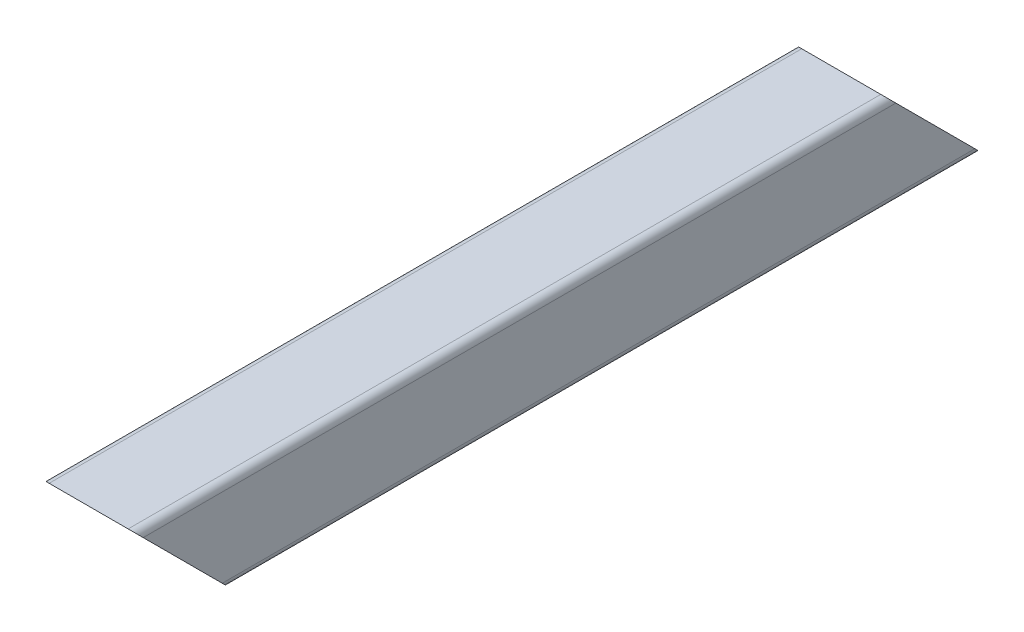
ISO-10303-21;
HEADER;
FILE_DESCRIPTION(('STEP AP214'),'2;1');
FILE_NAME('part.step','',(''),(''),'','','');
FILE_SCHEMA(('AUTOMOTIVE_DESIGN { 1 0 10303 214 1 1 1 1 }'));
ENDSEC;
DATA;
#1=APPLICATION_CONTEXT('core data for automotive mechanical design processes');
#2=APPLICATION_PROTOCOL_DEFINITION('international standard','automotive_design',2000,#1);
#3=PRODUCT_CONTEXT('',#1,'mechanical');
#4=PRODUCT('Part','Part','',(#3));
#5=PRODUCT_RELATED_PRODUCT_CATEGORY('part','',(#4));
#6=PRODUCT_DEFINITION_FORMATION('','',#4);
#7=PRODUCT_DEFINITION_CONTEXT('part definition',#1,'design');
#8=PRODUCT_DEFINITION('design','',#6,#7);
#9=PRODUCT_DEFINITION_SHAPE('','',#8);
#10=(LENGTH_UNIT() NAMED_UNIT(*) SI_UNIT(.MILLI.,.METRE.));
#11=(NAMED_UNIT(*) PLANE_ANGLE_UNIT() SI_UNIT($,.RADIAN.));
#12=(NAMED_UNIT(*) SI_UNIT($,.STERADIAN.) SOLID_ANGLE_UNIT());
#13=UNCERTAINTY_MEASURE_WITH_UNIT(LENGTH_MEASURE(1.E-05),#10,'distance_accuracy_value','');
#14=(GEOMETRIC_REPRESENTATION_CONTEXT(3) GLOBAL_UNCERTAINTY_ASSIGNED_CONTEXT((#13)) GLOBAL_UNIT_ASSIGNED_CONTEXT((#10,
#11,#12)) REPRESENTATION_CONTEXT('',''));
#15=CARTESIAN_POINT('',(0.,0.,0.));
#16=DIRECTION('',(0.,0.,1.));
#17=DIRECTION('',(1.,0.,0.));
#18=AXIS2_PLACEMENT_3D('',#15,#16,#17);
#19=CARTESIAN_POINT('',(4.,-4.,450.));
#20=DIRECTION('',(0.,0.,-1.));
#21=DIRECTION('',(-1.,0.,0.));
#22=AXIS2_PLACEMENT_3D('',#19,#20,#21);
#23=CYLINDRICAL_SURFACE('',#22,4.);
#24=DIRECTION('',(0.,0.,-1.));
#25=VECTOR('',#24,1.);
#26=CARTESIAN_POINT('',(4.00000000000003,0.,450.));
#27=LINE('',#26,#25);
#28=CARTESIAN_POINT('',(4.00000000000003,0.,450.));
#29=VERTEX_POINT('',#28);
#30=CARTESIAN_POINT('',(4.00000000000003,0.,50.0000000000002));
#31=VERTEX_POINT('',#30);
#32=EDGE_CURVE('E217',#29,#31,#27,.T.);
#33=ORIENTED_EDGE('',*,*,#32,.T.);
#34=CARTESIAN_POINT('',(4.,-4.,46.0000000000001));
#35=DIRECTION('',(0.,-0.707106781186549,0.707106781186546));
#36=DIRECTION('',(0.,-0.707106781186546,-0.707106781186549));
#37=AXIS2_PLACEMENT_3D('',#34,#35,#36);
#38=ELLIPSE('',#37,5.65685424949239,4.);
#39=CARTESIAN_POINT('',(0.,-4.00000000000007,46.0000000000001));
#40=VERTEX_POINT('',#39);
#41=EDGE_CURVE('E42',#31,#40,#38,.T.);
#42=ORIENTED_EDGE('',*,*,#41,.T.);
#43=DIRECTION('',(0.,0.,-1.));
#44=VECTOR('',#43,1.);
#45=CARTESIAN_POINT('',(0.,-4.00000000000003,450.));
#46=LINE('',#45,#44);
#47=CARTESIAN_POINT('',(0.,-4.00000000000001,446.));
#48=VERTEX_POINT('',#47);
#49=EDGE_CURVE('E156',#48,#40,#46,.T.);
#50=ORIENTED_EDGE('',*,*,#49,.F.);
#51=CARTESIAN_POINT('',(4.,-4.,446.));
#52=DIRECTION('',(0.,0.707106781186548,-0.707106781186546));
#53=DIRECTION('',(0.,-0.707106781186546,-0.707106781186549));
#54=AXIS2_PLACEMENT_3D('',#51,#52,#53);
#55=ELLIPSE('',#54,5.65685424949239,4.);
#56=EDGE_CURVE('E196',#48,#29,#55,.T.);
#57=ORIENTED_EDGE('',*,*,#56,.T.);
#58=EDGE_LOOP('',(#33,#42,#50,#57));
#59=FACE_BOUND('',#58,.T.);
#60=ADVANCED_FACE('F28',(#59),#23,.T.);
#61=CARTESIAN_POINT('',(0.,-4.00000000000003,450.));
#62=DIRECTION('',(1.,0.,0.));
#63=DIRECTION('',(0.,1.,0.));
#64=AXIS2_PLACEMENT_3D('',#61,#62,#63);
#65=PLANE('',#64);
#66=ORIENTED_EDGE('',*,*,#49,.T.);
#67=DIRECTION('',(0.,0.707106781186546,0.707106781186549));
#68=VECTOR('',#67,1.);
#69=CARTESIAN_POINT('',(0.,-50.,0.));
#70=LINE('',#69,#68);
#71=CARTESIAN_POINT('',(0.,-46.,4.00000000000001));
#72=VERTEX_POINT('',#71);
#73=EDGE_CURVE('E140',#72,#40,#70,.T.);
#74=ORIENTED_EDGE('',*,*,#73,.F.);
#75=DIRECTION('',(0.,0.,-1.));
#76=VECTOR('',#75,1.);
#77=CARTESIAN_POINT('',(0.,-46.,450.));
#78=LINE('',#77,#76);
#79=CARTESIAN_POINT('',(0.,-46.,404.));
#80=VERTEX_POINT('',#79);
#81=EDGE_CURVE('E154',#80,#72,#78,.T.);
#82=ORIENTED_EDGE('',*,*,#81,.F.);
#83=DIRECTION('',(0.,-0.707106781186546,-0.707106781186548));
#84=VECTOR('',#83,1.);
#85=CARTESIAN_POINT('',(0.,0.,450.));
#86=LINE('',#85,#84);
#87=EDGE_CURVE('E242',#48,#80,#86,.T.);
#88=ORIENTED_EDGE('',*,*,#87,.F.);
#89=EDGE_LOOP('',(#66,#74,#82,#88));
#90=FACE_BOUND('',#89,.T.);
#91=ADVANCED_FACE('F152',(#90),#65,.F.);
#92=CARTESIAN_POINT('',(4.00000000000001,-46.,450.));
#93=DIRECTION('',(0.,0.,-1.));
#94=DIRECTION('',(-1.,0.,0.));
#95=AXIS2_PLACEMENT_3D('',#92,#93,#94);
#96=CYLINDRICAL_SURFACE('',#95,4.);
#97=ORIENTED_EDGE('',*,*,#81,.T.);
#98=CARTESIAN_POINT('',(4.00000000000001,-46.,4.));
#99=DIRECTION('',(0.,-0.707106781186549,0.707106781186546));
#100=DIRECTION('',(0.,-0.707106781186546,-0.707106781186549));
#101=AXIS2_PLACEMENT_3D('',#98,#99,#100);
#102=ELLIPSE('',#101,5.65685424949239,4.);
#103=CARTESIAN_POINT('',(4.00000000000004,-50.,0.));
#104=VERTEX_POINT('',#103);
#105=EDGE_CURVE('E137',#72,#104,#102,.T.);
#106=ORIENTED_EDGE('',*,*,#105,.T.);
#107=DIRECTION('',(0.,0.,-1.));
#108=VECTOR('',#107,1.);
#109=CARTESIAN_POINT('',(4.00000000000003,-50.,450.));
#110=LINE('',#109,#108);
#111=CARTESIAN_POINT('',(4.00000000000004,-50.,400.));
#112=VERTEX_POINT('',#111);
#113=EDGE_CURVE('E162',#112,#104,#110,.T.);
#114=ORIENTED_EDGE('',*,*,#113,.F.);
#115=CARTESIAN_POINT('',(4.00000000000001,-46.,404.));
#116=DIRECTION('',(0.,0.707106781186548,-0.707106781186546));
#117=DIRECTION('',(0.,-0.707106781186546,-0.707106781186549));
#118=AXIS2_PLACEMENT_3D('',#115,#116,#117);
#119=ELLIPSE('',#118,5.65685424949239,4.);
#120=EDGE_CURVE('E161',#112,#80,#119,.T.);
#121=ORIENTED_EDGE('',*,*,#120,.T.);
#122=EDGE_LOOP('',(#97,#106,#114,#121));
#123=FACE_BOUND('',#122,.T.);
#124=ADVANCED_FACE('F160',(#123),#96,.T.);
#125=CARTESIAN_POINT('',(4.00000000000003,-50.,450.));
#126=DIRECTION('',(0.,1.,0.));
#127=DIRECTION('',(0.,0.,1.));
#128=AXIS2_PLACEMENT_3D('',#125,#126,#127);
#129=PLANE('',#128);
#130=DIRECTION('',(0.,0.,-1.));
#131=VECTOR('',#130,1.);
#132=CARTESIAN_POINT('',(46.,-50.,450.));
#133=LINE('',#132,#131);
#134=CARTESIAN_POINT('',(46.,-50.,400.));
#135=VERTEX_POINT('',#134);
#136=CARTESIAN_POINT('',(46.,-50.,0.));
#137=VERTEX_POINT('',#136);
#138=EDGE_CURVE('E165',#135,#137,#133,.T.);
#139=ORIENTED_EDGE('',*,*,#138,.F.);
#140=DIRECTION('',(-1.,0.,0.));
#141=VECTOR('',#140,1.);
#142=CARTESIAN_POINT('',(50.,-50.,400.));
#143=LINE('',#142,#141);
#144=EDGE_CURVE('E189',#135,#112,#143,.T.);
#145=ORIENTED_EDGE('',*,*,#144,.T.);
#146=ORIENTED_EDGE('',*,*,#113,.T.);
#147=DIRECTION('',(1.,0.,0.));
#148=VECTOR('',#147,1.);
#149=CARTESIAN_POINT('',(4.00000000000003,-50.,0.));
#150=LINE('',#149,#148);
#151=EDGE_CURVE('E142',#104,#137,#150,.T.);
#152=ORIENTED_EDGE('',*,*,#151,.T.);
#153=EDGE_LOOP('',(#139,#145,#146,#152));
#154=FACE_BOUND('',#153,.T.);
#155=ADVANCED_FACE('F238',(#154),#129,.F.);
#156=CARTESIAN_POINT('',(46.,-46.,450.));
#157=DIRECTION('',(0.,0.,-1.));
#158=DIRECTION('',(-1.,0.,0.));
#159=AXIS2_PLACEMENT_3D('',#156,#157,#158);
#160=CYLINDRICAL_SURFACE('',#159,4.);
#161=ORIENTED_EDGE('',*,*,#138,.T.);
#162=CARTESIAN_POINT('',(46.,-46.,4.));
#163=DIRECTION('',(0.,-0.707106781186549,0.707106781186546));
#164=DIRECTION('',(0.,-0.707106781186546,-0.707106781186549));
#165=AXIS2_PLACEMENT_3D('',#162,#163,#164);
#166=ELLIPSE('',#165,5.65685424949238,4.);
#167=CARTESIAN_POINT('',(50.,-46.,4.00000000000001));
#168=VERTEX_POINT('',#167);
#169=EDGE_CURVE('E147',#137,#168,#166,.T.);
#170=ORIENTED_EDGE('',*,*,#169,.T.);
#171=DIRECTION('',(0.,0.,-1.));
#172=VECTOR('',#171,1.);
#173=CARTESIAN_POINT('',(50.,-46.,450.));
#174=LINE('',#173,#172);
#175=CARTESIAN_POINT('',(50.,-46.,404.));
#176=VERTEX_POINT('',#175);
#177=EDGE_CURVE('E226',#176,#168,#174,.T.);
#178=ORIENTED_EDGE('',*,*,#177,.F.);
#179=CARTESIAN_POINT('',(46.,-46.,404.));
#180=DIRECTION('',(0.,0.707106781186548,-0.707106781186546));
#181=DIRECTION('',(0.,-0.707106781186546,-0.707106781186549));
#182=AXIS2_PLACEMENT_3D('',#179,#180,#181);
#183=ELLIPSE('',#182,5.65685424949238,4.);
#184=EDGE_CURVE('E235',#176,#135,#183,.T.);
#185=ORIENTED_EDGE('',*,*,#184,.T.);
#186=EDGE_LOOP('',(#161,#170,#178,#185));
#187=FACE_BOUND('',#186,.T.);
#188=ADVANCED_FACE('F233',(#187),#160,.T.);
#189=CARTESIAN_POINT('',(50.,-4.00000000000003,450.));
#190=DIRECTION('',(-1.,0.,0.));
#191=DIRECTION('',(0.,0.,1.));
#192=AXIS2_PLACEMENT_3D('',#189,#190,#191);
#193=PLANE('',#192);
#194=ORIENTED_EDGE('',*,*,#177,.T.);
#195=DIRECTION('',(0.,0.707106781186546,0.707106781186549));
#196=VECTOR('',#195,1.);
#197=CARTESIAN_POINT('',(50.,-50.,0.));
#198=LINE('',#197,#196);
#199=CARTESIAN_POINT('',(50.,-4.,46.0000000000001));
#200=VERTEX_POINT('',#199);
#201=EDGE_CURVE('E157',#168,#200,#198,.T.);
#202=ORIENTED_EDGE('',*,*,#201,.T.);
#203=DIRECTION('',(0.,0.,-1.));
#204=VECTOR('',#203,1.);
#205=CARTESIAN_POINT('',(50.,-4.00000000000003,450.));
#206=LINE('',#205,#204);
#207=CARTESIAN_POINT('',(50.,-4.,446.));
#208=VERTEX_POINT('',#207);
#209=EDGE_CURVE('E223',#208,#200,#206,.T.);
#210=ORIENTED_EDGE('',*,*,#209,.F.);
#211=DIRECTION('',(0.,-0.707106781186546,-0.707106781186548));
#212=VECTOR('',#211,1.);
#213=CARTESIAN_POINT('',(50.,0.,450.));
#214=LINE('',#213,#212);
#215=EDGE_CURVE('E239',#208,#176,#214,.T.);
#216=ORIENTED_EDGE('',*,*,#215,.T.);
#217=EDGE_LOOP('',(#194,#202,#210,#216));
#218=FACE_BOUND('',#217,.T.);
#219=ADVANCED_FACE('F310',(#218),#193,.F.);
#220=CARTESIAN_POINT('',(46.,-4.,450.));
#221=DIRECTION('',(0.,0.,-1.));
#222=DIRECTION('',(-1.,0.,0.));
#223=AXIS2_PLACEMENT_3D('',#220,#221,#222);
#224=CYLINDRICAL_SURFACE('',#223,4.);
#225=ORIENTED_EDGE('',*,*,#209,.T.);
#226=CARTESIAN_POINT('',(46.,-4.,46.0000000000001));
#227=DIRECTION('',(0.,-0.707106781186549,0.707106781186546));
#228=DIRECTION('',(0.,-0.707106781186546,-0.707106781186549));
#229=AXIS2_PLACEMENT_3D('',#226,#227,#228);
#230=ELLIPSE('',#229,5.65685424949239,4.);
#231=CARTESIAN_POINT('',(46.,0.,50.0000000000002));
#232=VERTEX_POINT('',#231);
#233=EDGE_CURVE('E286',#200,#232,#230,.T.);
#234=ORIENTED_EDGE('',*,*,#233,.T.);
#235=DIRECTION('',(0.,0.,-1.));
#236=VECTOR('',#235,1.);
#237=CARTESIAN_POINT('',(46.,0.,450.));
#238=LINE('',#237,#236);
#239=CARTESIAN_POINT('',(46.,0.,450.));
#240=VERTEX_POINT('',#239);
#241=EDGE_CURVE('E220',#240,#232,#238,.T.);
#242=ORIENTED_EDGE('',*,*,#241,.F.);
#243=CARTESIAN_POINT('',(46.,-4.,446.));
#244=DIRECTION('',(0.,0.707106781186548,-0.707106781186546));
#245=DIRECTION('',(0.,-0.707106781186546,-0.707106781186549));
#246=AXIS2_PLACEMENT_3D('',#243,#244,#245);
#247=ELLIPSE('',#246,5.65685424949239,4.);
#248=EDGE_CURVE('E256',#240,#208,#247,.T.);
#249=ORIENTED_EDGE('',*,*,#248,.T.);
#250=EDGE_LOOP('',(#225,#234,#242,#249));
#251=FACE_BOUND('',#250,.T.);
#252=ADVANCED_FACE('F313',(#251),#224,.T.);
#253=CARTESIAN_POINT('',(4.00000000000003,0.,450.));
#254=DIRECTION('',(0.,-1.,0.));
#255=DIRECTION('',(0.,0.,-1.));
#256=AXIS2_PLACEMENT_3D('',#253,#254,#255);
#257=PLANE('',#256);
#258=ORIENTED_EDGE('',*,*,#241,.T.);
#259=DIRECTION('',(-1.,0.,0.));
#260=VECTOR('',#259,1.);
#261=CARTESIAN_POINT('',(50.,0.,50.0000000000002));
#262=LINE('',#261,#260);
#263=EDGE_CURVE('E266',#232,#31,#262,.T.);
#264=ORIENTED_EDGE('',*,*,#263,.T.);
#265=ORIENTED_EDGE('',*,*,#32,.F.);
#266=DIRECTION('',(-1.,0.,0.));
#267=VECTOR('',#266,1.);
#268=CARTESIAN_POINT('',(4.00000000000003,0.,450.));
#269=LINE('',#268,#267);
#270=EDGE_CURVE('E215',#240,#29,#269,.T.);
#271=ORIENTED_EDGE('',*,*,#270,.F.);
#272=EDGE_LOOP('',(#258,#264,#265,#271));
#273=FACE_BOUND('',#272,.T.);
#274=ADVANCED_FACE('F265',(#273),#257,.F.);
#275=CARTESIAN_POINT('',(4.,-4.,450.));
#276=DIRECTION('',(0.,0.,-1.));
#277=DIRECTION('',(-1.,0.,0.));
#278=AXIS2_PLACEMENT_3D('',#275,#276,#277);
#279=CYLINDRICAL_SURFACE('',#278,0.999999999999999);
#280=CARTESIAN_POINT('',(4.,-4.,46.0000000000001));
#281=DIRECTION('',(0.,-0.707106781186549,0.707106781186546));
#282=DIRECTION('',(0.,-0.707106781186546,-0.707106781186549));
#283=AXIS2_PLACEMENT_3D('',#280,#281,#282);
#284=ELLIPSE('',#283,1.4142135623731,0.999999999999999);
#285=CARTESIAN_POINT('',(4.00000000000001,-3.,47.0000000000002));
#286=VERTEX_POINT('',#285);
#287=CARTESIAN_POINT('',(3.,-4.00000000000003,46.0000000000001));
#288=VERTEX_POINT('',#287);
#289=EDGE_CURVE('E284',#286,#288,#284,.T.);
#290=ORIENTED_EDGE('',*,*,#289,.F.);
#291=DIRECTION('',(0.,0.,-1.));
#292=VECTOR('',#291,1.);
#293=CARTESIAN_POINT('',(4.00000000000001,-3.,450.));
#294=LINE('',#293,#292);
#295=CARTESIAN_POINT('',(4.00000000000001,-3.,447.));
#296=VERTEX_POINT('',#295);
#297=EDGE_CURVE('E192',#296,#286,#294,.T.);
#298=ORIENTED_EDGE('',*,*,#297,.F.);
#299=CARTESIAN_POINT('',(4.,-4.,446.));
#300=DIRECTION('',(0.,0.707106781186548,-0.707106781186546));
#301=DIRECTION('',(0.,-0.707106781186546,-0.707106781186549));
#302=AXIS2_PLACEMENT_3D('',#299,#300,#301);
#303=ELLIPSE('',#302,1.4142135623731,0.999999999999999);
#304=CARTESIAN_POINT('',(3.,-4.00000000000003,446.));
#305=VERTEX_POINT('',#304);
#306=EDGE_CURVE('E176',#305,#296,#303,.T.);
#307=ORIENTED_EDGE('',*,*,#306,.F.);
#308=DIRECTION('',(0.,0.,-1.));
#309=VECTOR('',#308,1.);
#310=CARTESIAN_POINT('',(3.,-4.00000000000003,450.));
#311=LINE('',#310,#309);
#312=EDGE_CURVE('E211',#305,#288,#311,.T.);
#313=ORIENTED_EDGE('',*,*,#312,.T.);
#314=EDGE_LOOP('',(#290,#298,#307,#313));
#315=FACE_BOUND('',#314,.T.);
#316=ADVANCED_FACE('F320',(#315),#279,.F.);
#317=CARTESIAN_POINT('',(3.,-4.00000000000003,450.));
#318=DIRECTION('',(1.,0.,0.));
#319=DIRECTION('',(0.,1.,0.));
#320=AXIS2_PLACEMENT_3D('',#317,#318,#319);
#321=PLANE('',#320);
#322=DIRECTION('',(0.,-0.707106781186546,-0.707106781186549));
#323=VECTOR('',#322,1.);
#324=CARTESIAN_POINT('',(2.99999999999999,198.,248.000000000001));
#325=LINE('',#324,#323);
#326=CARTESIAN_POINT('',(3.,-46.,4.));
#327=VERTEX_POINT('',#326);
#328=EDGE_CURVE('E282',#288,#327,#325,.T.);
#329=ORIENTED_EDGE('',*,*,#328,.F.);
#330=ORIENTED_EDGE('',*,*,#312,.F.);
#331=DIRECTION('',(0.,0.707106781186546,0.707106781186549));
#332=VECTOR('',#331,1.);
#333=CARTESIAN_POINT('',(3.,-2.00000000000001,448.));
#334=LINE('',#333,#332);
#335=CARTESIAN_POINT('',(3.,-46.,404.));
#336=VERTEX_POINT('',#335);
#337=EDGE_CURVE('E253',#336,#305,#334,.T.);
#338=ORIENTED_EDGE('',*,*,#337,.F.);
#339=DIRECTION('',(0.,0.,-1.));
#340=VECTOR('',#339,1.);
#341=CARTESIAN_POINT('',(3.,-46.,450.));
#342=LINE('',#341,#340);
#343=EDGE_CURVE('E208',#336,#327,#342,.T.);
#344=ORIENTED_EDGE('',*,*,#343,.T.);
#345=EDGE_LOOP('',(#329,#330,#338,#344));
#346=FACE_BOUND('',#345,.T.);
#347=ADVANCED_FACE('F323',(#346),#321,.T.);
#348=CARTESIAN_POINT('',(4.00000000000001,-46.,450.));
#349=DIRECTION('',(0.,0.,-1.));
#350=DIRECTION('',(-1.,0.,0.));
#351=AXIS2_PLACEMENT_3D('',#348,#349,#350);
#352=CYLINDRICAL_SURFACE('',#351,1.);
#353=CARTESIAN_POINT('',(4.00000000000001,-46.,4.));
#354=DIRECTION('',(0.,-0.707106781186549,0.707106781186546));
#355=DIRECTION('',(0.,-0.707106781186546,-0.707106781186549));
#356=AXIS2_PLACEMENT_3D('',#353,#354,#355);
#357=ELLIPSE('',#356,1.4142135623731,1.);
#358=CARTESIAN_POINT('',(4.00000000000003,-47.,3.));
#359=VERTEX_POINT('',#358);
#360=EDGE_CURVE('E280',#327,#359,#357,.T.);
#361=ORIENTED_EDGE('',*,*,#360,.F.);
#362=ORIENTED_EDGE('',*,*,#343,.F.);
#363=CARTESIAN_POINT('',(4.00000000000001,-46.,404.));
#364=DIRECTION('',(0.,0.707106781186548,-0.707106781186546));
#365=DIRECTION('',(0.,-0.707106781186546,-0.707106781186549));
#366=AXIS2_PLACEMENT_3D('',#363,#364,#365);
#367=ELLIPSE('',#366,1.4142135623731,1.);
#368=CARTESIAN_POINT('',(4.00000000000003,-47.,403.));
#369=VERTEX_POINT('',#368);
#370=EDGE_CURVE('E251',#369,#336,#367,.T.);
#371=ORIENTED_EDGE('',*,*,#370,.F.);
#372=DIRECTION('',(0.,0.,-1.));
#373=VECTOR('',#372,1.);
#374=CARTESIAN_POINT('',(4.00000000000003,-47.,450.));
#375=LINE('',#374,#373);
#376=EDGE_CURVE('E205',#369,#359,#375,.T.);
#377=ORIENTED_EDGE('',*,*,#376,.T.);
#378=EDGE_LOOP('',(#361,#362,#371,#377));
#379=FACE_BOUND('',#378,.T.);
#380=ADVANCED_FACE('F327',(#379),#352,.F.);
#381=CARTESIAN_POINT('',(4.00000000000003,-47.,450.));
#382=DIRECTION('',(0.,1.,0.));
#383=DIRECTION('',(0.,0.,1.));
#384=AXIS2_PLACEMENT_3D('',#381,#382,#383);
#385=PLANE('',#384);
#386=DIRECTION('',(1.,0.,0.));
#387=VECTOR('',#386,1.);
#388=CARTESIAN_POINT('',(3.99999999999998,-47.,3.));
#389=LINE('',#388,#387);
#390=CARTESIAN_POINT('',(46.,-47.,3.));
#391=VERTEX_POINT('',#390);
#392=EDGE_CURVE('E278',#359,#391,#389,.T.);
#393=ORIENTED_EDGE('',*,*,#392,.F.);
#394=ORIENTED_EDGE('',*,*,#376,.F.);
#395=DIRECTION('',(-1.,0.,0.));
#396=VECTOR('',#395,1.);
#397=CARTESIAN_POINT('',(4.00000000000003,-47.,403.));
#398=LINE('',#397,#396);
#399=CARTESIAN_POINT('',(46.,-47.,403.));
#400=VERTEX_POINT('',#399);
#401=EDGE_CURVE('E249',#400,#369,#398,.T.);
#402=ORIENTED_EDGE('',*,*,#401,.F.);
#403=DIRECTION('',(0.,0.,-1.));
#404=VECTOR('',#403,1.);
#405=CARTESIAN_POINT('',(46.,-47.,450.));
#406=LINE('',#405,#404);
#407=EDGE_CURVE('E202',#400,#391,#406,.T.);
#408=ORIENTED_EDGE('',*,*,#407,.T.);
#409=EDGE_LOOP('',(#393,#394,#402,#408));
#410=FACE_BOUND('',#409,.T.);
#411=ADVANCED_FACE('F331',(#410),#385,.T.);
#412=CARTESIAN_POINT('',(46.,-46.,450.));
#413=DIRECTION('',(0.,0.,-1.));
#414=DIRECTION('',(-1.,0.,0.));
#415=AXIS2_PLACEMENT_3D('',#412,#413,#414);
#416=CYLINDRICAL_SURFACE('',#415,0.999999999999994);
#417=CARTESIAN_POINT('',(46.,-46.,4.));
#418=DIRECTION('',(0.,-0.707106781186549,0.707106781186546));
#419=DIRECTION('',(0.,-0.707106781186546,-0.707106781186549));
#420=AXIS2_PLACEMENT_3D('',#417,#418,#419);
#421=ELLIPSE('',#420,1.41421356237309,0.999999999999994);
#422=CARTESIAN_POINT('',(47.,-46.,4.));
#423=VERTEX_POINT('',#422);
#424=EDGE_CURVE('E276',#391,#423,#421,.T.);
#425=ORIENTED_EDGE('',*,*,#424,.F.);
#426=ORIENTED_EDGE('',*,*,#407,.F.);
#427=CARTESIAN_POINT('',(46.,-46.,404.));
#428=DIRECTION('',(0.,0.707106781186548,-0.707106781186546));
#429=DIRECTION('',(0.,-0.707106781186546,-0.707106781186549));
#430=AXIS2_PLACEMENT_3D('',#427,#428,#429);
#431=ELLIPSE('',#430,1.41421356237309,0.999999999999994);
#432=CARTESIAN_POINT('',(47.,-46.,404.));
#433=VERTEX_POINT('',#432);
#434=EDGE_CURVE('E247',#433,#400,#431,.T.);
#435=ORIENTED_EDGE('',*,*,#434,.F.);
#436=DIRECTION('',(0.,0.,-1.));
#437=VECTOR('',#436,1.);
#438=CARTESIAN_POINT('',(47.,-46.,450.));
#439=LINE('',#438,#437);
#440=EDGE_CURVE('E194',#433,#423,#439,.T.);
#441=ORIENTED_EDGE('',*,*,#440,.T.);
#442=EDGE_LOOP('',(#425,#426,#435,#441));
#443=FACE_BOUND('',#442,.T.);
#444=ADVANCED_FACE('F335',(#443),#416,.F.);
#445=CARTESIAN_POINT('',(47.,-4.00000000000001,450.));
#446=DIRECTION('',(-1.,0.,0.));
#447=DIRECTION('',(0.,-1.,0.));
#448=AXIS2_PLACEMENT_3D('',#445,#446,#447);
#449=PLANE('',#448);
#450=DIRECTION('',(0.,0.707106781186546,0.707106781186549));
#451=VECTOR('',#450,1.);
#452=CARTESIAN_POINT('',(47.,198.,248.000000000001));
#453=LINE('',#452,#451);
#454=CARTESIAN_POINT('',(47.,-4.00000000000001,46.0000000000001));
#455=VERTEX_POINT('',#454);
#456=EDGE_CURVE('E270',#423,#455,#453,.T.);
#457=ORIENTED_EDGE('',*,*,#456,.F.);
#458=ORIENTED_EDGE('',*,*,#440,.F.);
#459=DIRECTION('',(0.,-0.707106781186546,-0.707106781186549));
#460=VECTOR('',#459,1.);
#461=CARTESIAN_POINT('',(47.,-1.99999999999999,448.));
#462=LINE('',#461,#460);
#463=CARTESIAN_POINT('',(47.,-4.00000000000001,446.));
#464=VERTEX_POINT('',#463);
#465=EDGE_CURVE('E188',#464,#433,#462,.T.);
#466=ORIENTED_EDGE('',*,*,#465,.F.);
#467=DIRECTION('',(0.,0.,-1.));
#468=VECTOR('',#467,1.);
#469=CARTESIAN_POINT('',(47.,-4.00000000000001,450.));
#470=LINE('',#469,#468);
#471=EDGE_CURVE('E187',#464,#455,#470,.T.);
#472=ORIENTED_EDGE('',*,*,#471,.T.);
#473=EDGE_LOOP('',(#457,#458,#466,#472));
#474=FACE_BOUND('',#473,.T.);
#475=ADVANCED_FACE('F339',(#474),#449,.T.);
#476=CARTESIAN_POINT('',(46.,-4.,450.));
#477=DIRECTION('',(0.,0.,-1.));
#478=DIRECTION('',(-1.,0.,0.));
#479=AXIS2_PLACEMENT_3D('',#476,#477,#478);
#480=CYLINDRICAL_SURFACE('',#479,1.);
#481=CARTESIAN_POINT('',(46.,-4.,46.0000000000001));
#482=DIRECTION('',(0.,-0.707106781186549,0.707106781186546));
#483=DIRECTION('',(0.,-0.707106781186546,-0.707106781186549));
#484=AXIS2_PLACEMENT_3D('',#481,#482,#483);
#485=ELLIPSE('',#484,1.4142135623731,1.);
#486=CARTESIAN_POINT('',(46.,-3.,47.0000000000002));
#487=VERTEX_POINT('',#486);
#488=EDGE_CURVE('E49',#455,#487,#485,.T.);
#489=ORIENTED_EDGE('',*,*,#488,.F.);
#490=ORIENTED_EDGE('',*,*,#471,.F.);
#491=CARTESIAN_POINT('',(46.,-4.,446.));
#492=DIRECTION('',(0.,0.707106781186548,-0.707106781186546));
#493=DIRECTION('',(0.,-0.707106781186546,-0.707106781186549));
#494=AXIS2_PLACEMENT_3D('',#491,#492,#493);
#495=ELLIPSE('',#494,1.4142135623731,1.);
#496=CARTESIAN_POINT('',(46.,-3.,447.));
#497=VERTEX_POINT('',#496);
#498=EDGE_CURVE('E173',#497,#464,#495,.T.);
#499=ORIENTED_EDGE('',*,*,#498,.F.);
#500=DIRECTION('',(0.,0.,-1.));
#501=VECTOR('',#500,1.);
#502=CARTESIAN_POINT('',(46.,-3.,450.));
#503=LINE('',#502,#501);
#504=EDGE_CURVE('E185',#497,#487,#503,.T.);
#505=ORIENTED_EDGE('',*,*,#504,.T.);
#506=EDGE_LOOP('',(#489,#490,#499,#505));
#507=FACE_BOUND('',#506,.T.);
#508=ADVANCED_FACE('F184',(#507),#480,.F.);
#509=CARTESIAN_POINT('',(4.00000000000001,-3.,450.));
#510=DIRECTION('',(0.,-1.,0.));
#511=DIRECTION('',(0.,0.,-1.));
#512=AXIS2_PLACEMENT_3D('',#509,#510,#511);
#513=PLANE('',#512);
#514=DIRECTION('',(-1.,0.,0.));
#515=VECTOR('',#514,1.);
#516=CARTESIAN_POINT('',(3.99999999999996,-3.,47.0000000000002));
#517=LINE('',#516,#515);
#518=EDGE_CURVE('E11',#487,#286,#517,.T.);
#519=ORIENTED_EDGE('',*,*,#518,.F.);
#520=ORIENTED_EDGE('',*,*,#504,.F.);
#521=DIRECTION('',(1.,0.,0.));
#522=VECTOR('',#521,1.);
#523=CARTESIAN_POINT('',(4.00000000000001,-3.,447.));
#524=LINE('',#523,#522);
#525=EDGE_CURVE('E35',#296,#497,#524,.T.);
#526=ORIENTED_EDGE('',*,*,#525,.F.);
#527=ORIENTED_EDGE('',*,*,#297,.T.);
#528=EDGE_LOOP('',(#519,#520,#526,#527));
#529=FACE_BOUND('',#528,.T.);
#530=ADVANCED_FACE('F191',(#529),#513,.T.);
#531=CARTESIAN_POINT('',(50.,0.,450.));
#532=DIRECTION('',(0.,0.707106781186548,-0.707106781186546));
#533=DIRECTION('',(0.,0.707106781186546,0.707106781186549));
#534=AXIS2_PLACEMENT_3D('',#531,#532,#533);
#535=PLANE('',#534);
#536=ORIENTED_EDGE('',*,*,#306,.T.);
#537=ORIENTED_EDGE('',*,*,#525,.T.);
#538=ORIENTED_EDGE('',*,*,#498,.T.);
#539=ORIENTED_EDGE('',*,*,#465,.T.);
#540=ORIENTED_EDGE('',*,*,#434,.T.);
#541=ORIENTED_EDGE('',*,*,#401,.T.);
#542=ORIENTED_EDGE('',*,*,#370,.T.);
#543=ORIENTED_EDGE('',*,*,#337,.T.);
#544=EDGE_LOOP('',(#536,#537,#538,#539,#540,#541,#542,#543));
#545=FACE_BOUND('',#544,.T.);
#546=ORIENTED_EDGE('',*,*,#87,.T.);
#547=ORIENTED_EDGE('',*,*,#120,.F.);
#548=ORIENTED_EDGE('',*,*,#144,.F.);
#549=ORIENTED_EDGE('',*,*,#184,.F.);
#550=ORIENTED_EDGE('',*,*,#215,.F.);
#551=ORIENTED_EDGE('',*,*,#248,.F.);
#552=ORIENTED_EDGE('',*,*,#270,.T.);
#553=ORIENTED_EDGE('',*,*,#56,.F.);
#554=EDGE_LOOP('',(#546,#547,#548,#549,#550,#551,#552,#553));
#555=FACE_BOUND('',#554,.T.);
#556=ADVANCED_FACE('F171',(#545,#555),#535,.F.);
#557=CARTESIAN_POINT('',(50.,-50.,0.));
#558=DIRECTION('',(0.,-0.707106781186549,0.707106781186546));
#559=DIRECTION('',(0.,-0.707106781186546,-0.707106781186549));
#560=AXIS2_PLACEMENT_3D('',#557,#558,#559);
#561=PLANE('',#560);
#562=ORIENTED_EDGE('',*,*,#289,.T.);
#563=ORIENTED_EDGE('',*,*,#328,.T.);
#564=ORIENTED_EDGE('',*,*,#360,.T.);
#565=ORIENTED_EDGE('',*,*,#392,.T.);
#566=ORIENTED_EDGE('',*,*,#424,.T.);
#567=ORIENTED_EDGE('',*,*,#456,.T.);
#568=ORIENTED_EDGE('',*,*,#488,.T.);
#569=ORIENTED_EDGE('',*,*,#518,.T.);
#570=EDGE_LOOP('',(#562,#563,#564,#565,#566,#567,#568,#569));
#571=FACE_BOUND('',#570,.T.);
#572=ORIENTED_EDGE('',*,*,#263,.F.);
#573=ORIENTED_EDGE('',*,*,#233,.F.);
#574=ORIENTED_EDGE('',*,*,#201,.F.);
#575=ORIENTED_EDGE('',*,*,#169,.F.);
#576=ORIENTED_EDGE('',*,*,#151,.F.);
#577=ORIENTED_EDGE('',*,*,#105,.F.);
#578=ORIENTED_EDGE('',*,*,#73,.T.);
#579=ORIENTED_EDGE('',*,*,#41,.F.);
#580=EDGE_LOOP('',(#572,#573,#574,#575,#576,#577,#578,#579));
#581=FACE_BOUND('',#580,.T.);
#582=ADVANCED_FACE('F139',(#571,#581),#561,.F.);
#583=CLOSED_SHELL('',(#60,#91,#124,#155,#188,#219,#252,#274,#316,#347,#380,#411,#444,#475,#508,
#530,#556,#582));
#584=MANIFOLD_SOLID_BREP('B2',#583);
#585=ADVANCED_BREP_SHAPE_REPRESENTATION('',(#18,#584),#14);
#586=SHAPE_DEFINITION_REPRESENTATION(#9,#585);
ENDSEC;
END-ISO-10303-21;
